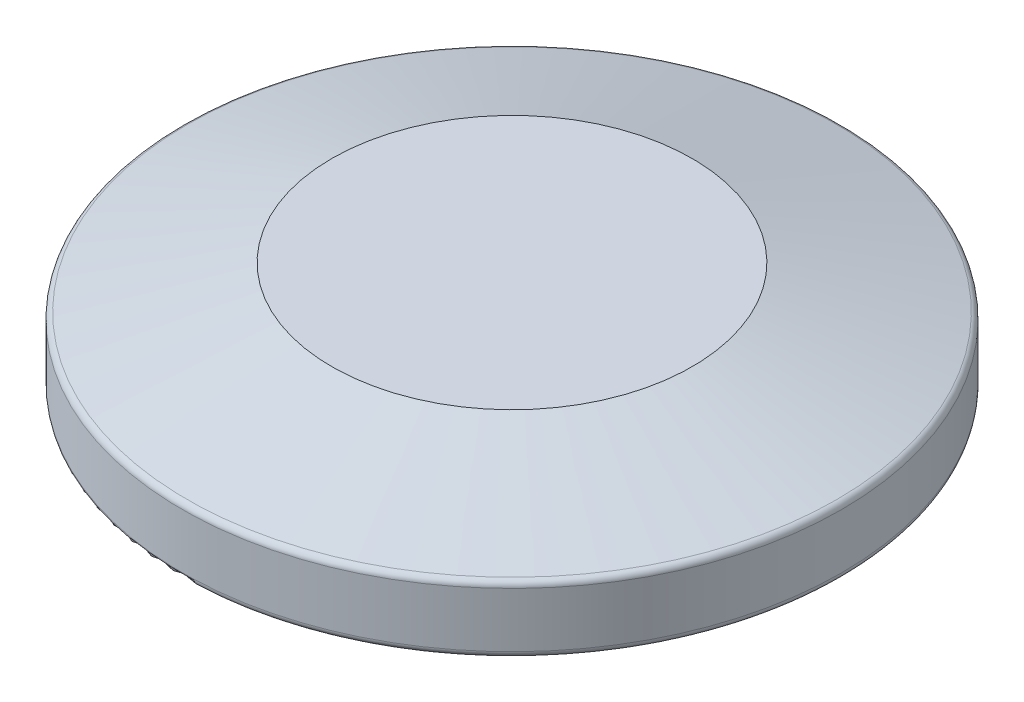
from build123d import *

# Parameters (mm, degrees)
FILLET_1_R = 0.3
FILLET_2_R = 0.3
FILLET_3_R = 0.3


with BuildPart() as part:
    # Sketch 1 → Revolve 1 (revolve)
    with BuildSketch(Plane.XY):
        Polygon((-8.65, 2.5), (-5.35, 2.5), (-5.35, 0), (0, 0), (0, 5), (-8.15, 5), (-14.9, 3), (-14.9, 0), (-8.65, 0), align=None)
    revolve(axis=Axis((0, 5, 0), (0, -1, 0)))

    # Fillet 1
    fillet_1_edges = [part.edges().sort_by_distance(p)[0] for p in [
        (14.9, 3, 0),
    ]]
    fillet(fillet_1_edges, radius=FILLET_1_R)

    # Fillet 2
    fillet_2_edges = [part.edges().sort_by_distance(p)[0] for p in [
        (14.9, 0, 0),
    ]]
    fillet(fillet_2_edges, radius=FILLET_2_R)

    # Fillet 3
    fillet_3_edges = [part.edges().sort_by_distance(p)[0] for p in [
        (8.65, 0, 0),
    ]]
    fillet(fillet_3_edges, radius=FILLET_3_R)


solid = part.part
